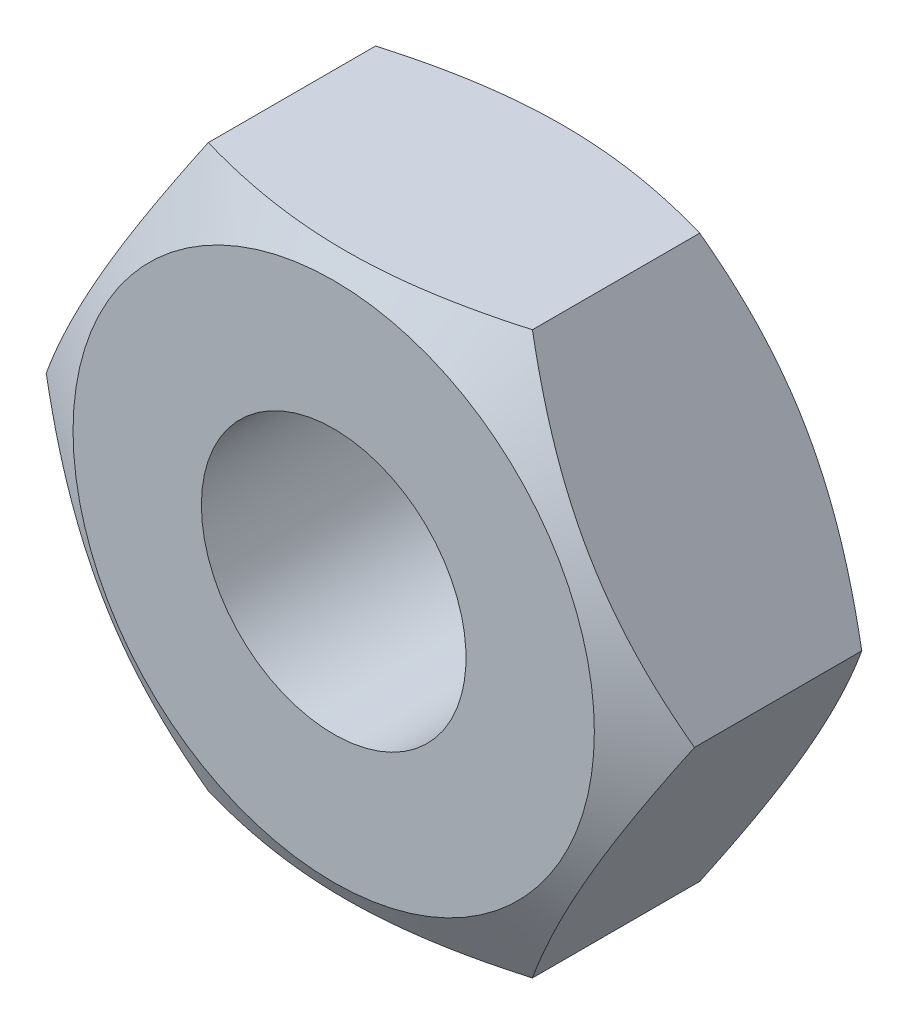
from build123d import *

# Parameters (mm, degrees)
BASE_EXTRUSION_DEPTH = 3
PER_AGE1_D           = 3.3


with BuildPart() as part:
    # Esquisse1 → Base-Extrusion (new body)
    with BuildSketch(Plane.XY):
        Polygon((-4.041451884, 0), (-2.020725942, 3.5), (2.020725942, 3.5), (4.041451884, 0), (2.020725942, -3.5), (-2.020725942, -3.5), align=None)
    extrude(amount=BASE_EXTRUSION_DEPTH)

    # Esquisse3 → Enlever de la mati_re-R_volution1 (revolve, cut)
    with BuildSketch(Plane(origin=(0, 0, 0), x_dir=(1, 0, 0), z_dir=(0, 1, 0)), mode=Mode.PRIVATE) as enlever_de_la_mati_re_r_volution1_sk:
        Polygon((-3.25, 0), (-4.041451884, 0), (-4.041451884, -0.456944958), align=None)
    enlever_de_la_mati_re_r_volution1 = revolve(enlever_de_la_mati_re_r_volution1_sk.sketch.rotate(Axis((0, 0, -2.852729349), (0, 0, 1)), 180), axis=Axis((0, 0, -2.852729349), (0, 0, 1)), mode=Mode.SUBTRACT)

    # Sym_trie1: Enlever de la mati_re-R_volution1 across plane
    add(enlever_de_la_mati_re_r_volution1.mirror(Plane(origin=(0, 0, 1.5), x_dir=(1, 0, 0), z_dir=(0, 0, -1))), mode=Mode.SUBTRACT)

    # Per_age1 (through all)
    with Locations(Plane(origin=(0, 0, 0), x_dir=(-1, 0, 0), z_dir=(0, 0, -1))):
        with Locations((0, 0)):
            Hole(PER_AGE1_D / 2)


solid = part.part
